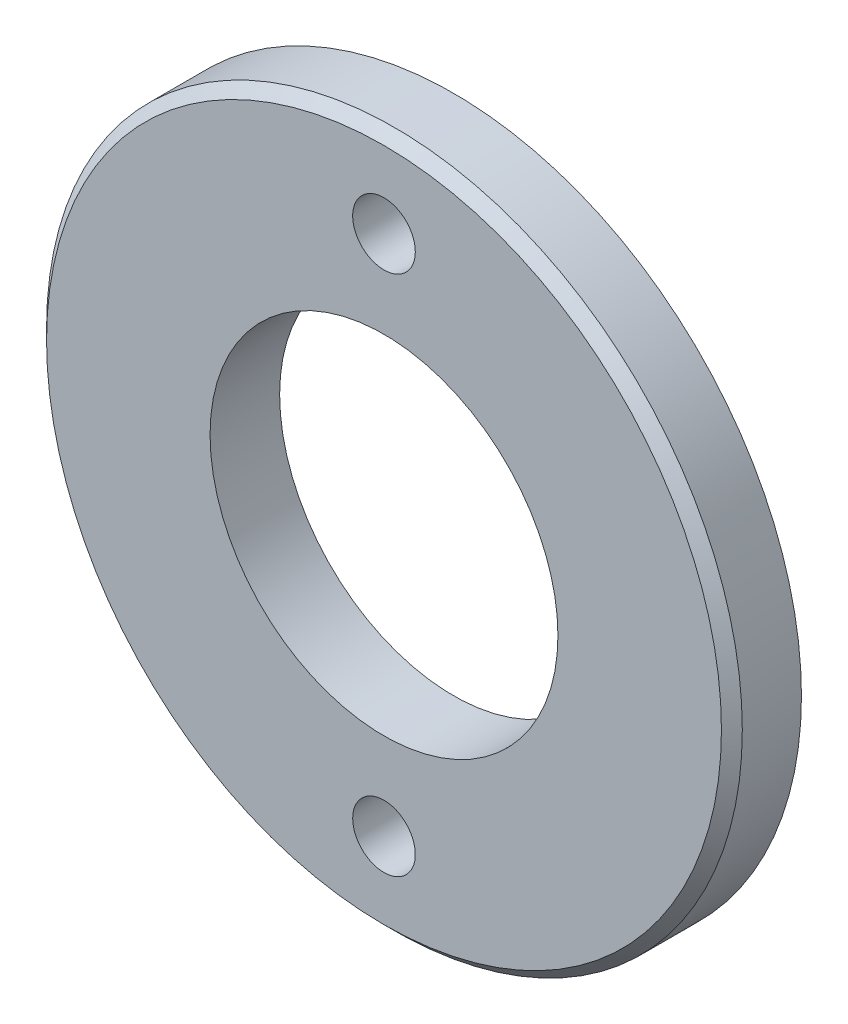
from build123d import *

# Parameters (mm, degrees)
SKETCH1_R          = 25.4
EXTRUDE1_DEPTH     = 2.54
SKETCH2_R          = 12.7
CUT_EXTRUDE1_DEPTH = 37.278456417
SKETCH3_R          = 2.286
CUT_EXTRUDE2_DEPTH = 37.278456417
CIRPATTERN1_COUNT  = 2
CHAMFER1_SIZE      = 0.762


with BuildPart() as part:
    # Sketch1 → Extrude1 (new, symmetric)
    with BuildSketch(Plane.XY):
        Circle(SKETCH1_R)
    extrude(amount=EXTRUDE1_DEPTH, both=True)

    # Sketch2 → Cut-Extrude1 (cut, through all)
    with BuildSketch(Plane.XY.offset(2.54)):
        Circle(SKETCH2_R)
    extrude(amount=-CUT_EXTRUDE1_DEPTH, mode=Mode.SUBTRACT)

    # Sketch3 → Cut-Extrude2 (cut, through all)
    with BuildSketch(Plane.XY.offset(2.54)):
        with Locations((0, 19.05)):
            Circle(SKETCH3_R)
    cut_extrude2 = extrude(amount=-CUT_EXTRUDE2_DEPTH, mode=Mode.SUBTRACT)

    # CirPattern1: Cut-Extrude2 ×2 about axis
    cirpattern1_axis = Axis((0, 0, 0), (0, 0, 1))
    for i in range(1, CIRPATTERN1_COUNT):
        add(cut_extrude2.rotate(cirpattern1_axis, i * 360 / CIRPATTERN1_COUNT), mode=Mode.SUBTRACT)

    # Chamfer1
    chamfer1_edges = [part.edges().sort_by_distance(p)[0] for p in [
        (-25.4, 0, 2.54),
    ]]
    chamfer(chamfer1_edges, length=CHAMFER1_SIZE)


solid = part.part
